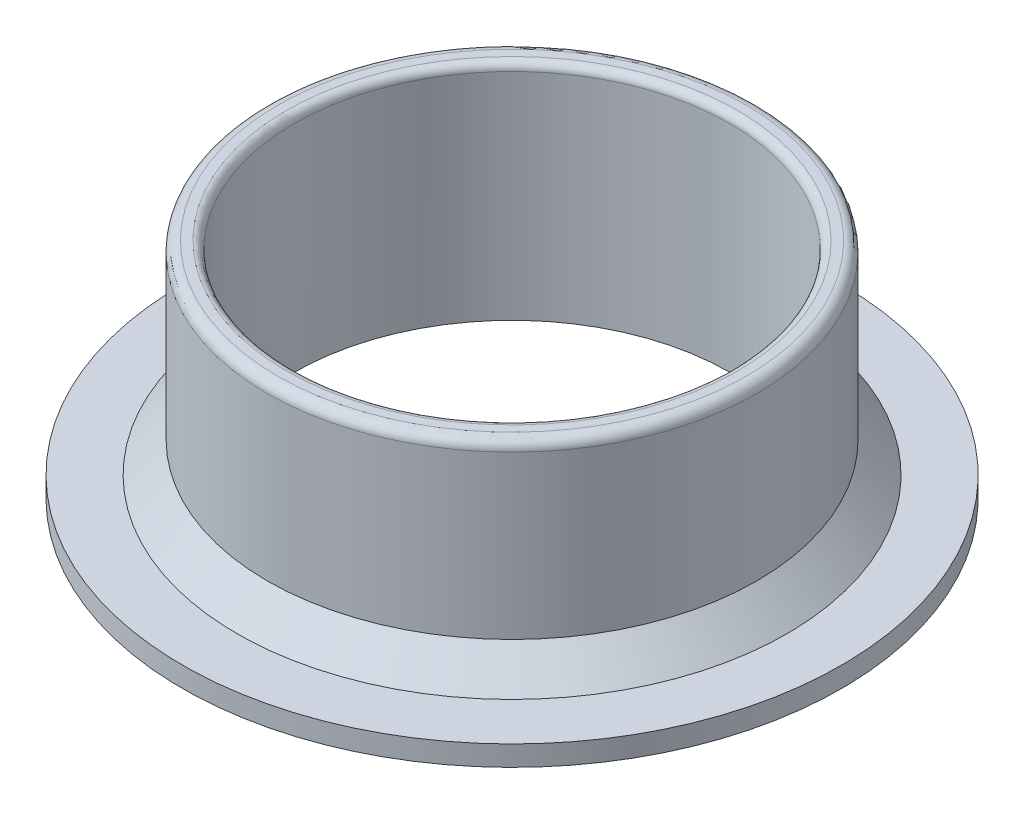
ISO-10303-21;
HEADER;
FILE_DESCRIPTION(('STEP AP214'),'2;1');
FILE_NAME('part.step','',(''),(''),'','','');
FILE_SCHEMA(('AUTOMOTIVE_DESIGN { 1 0 10303 214 1 1 1 1 }'));
ENDSEC;
DATA;
#1=APPLICATION_CONTEXT('core data for automotive mechanical design processes');
#2=APPLICATION_PROTOCOL_DEFINITION('international standard','automotive_design',2000,#1);
#3=PRODUCT_CONTEXT('',#1,'mechanical');
#4=PRODUCT('Part','Part','',(#3));
#5=PRODUCT_RELATED_PRODUCT_CATEGORY('part','',(#4));
#6=PRODUCT_DEFINITION_FORMATION('','',#4);
#7=PRODUCT_DEFINITION_CONTEXT('part definition',#1,'design');
#8=PRODUCT_DEFINITION('design','',#6,#7);
#9=PRODUCT_DEFINITION_SHAPE('','',#8);
#10=(LENGTH_UNIT() NAMED_UNIT(*) SI_UNIT(.MILLI.,.METRE.));
#11=(NAMED_UNIT(*) PLANE_ANGLE_UNIT() SI_UNIT($,.RADIAN.));
#12=(NAMED_UNIT(*) SI_UNIT($,.STERADIAN.) SOLID_ANGLE_UNIT());
#13=UNCERTAINTY_MEASURE_WITH_UNIT(LENGTH_MEASURE(1.E-05),#10,'distance_accuracy_value','');
#14=(GEOMETRIC_REPRESENTATION_CONTEXT(3) GLOBAL_UNCERTAINTY_ASSIGNED_CONTEXT((#13)) GLOBAL_UNIT_ASSIGNED_CONTEXT((#10,
#11,#12)) REPRESENTATION_CONTEXT('',''));
#15=CARTESIAN_POINT('',(0.,0.,0.));
#16=DIRECTION('',(0.,0.,1.));
#17=DIRECTION('',(1.,0.,0.));
#18=AXIS2_PLACEMENT_3D('',#15,#16,#17);
#19=CARTESIAN_POINT('',(0.,10.,0.));
#20=DIRECTION('',(0.,1.,0.));
#21=DIRECTION('',(0.,0.,1.));
#22=AXIS2_PLACEMENT_3D('',#19,#20,#21);
#23=PLANE('',#22);
#24=CARTESIAN_POINT('',(0.,10.,0.));
#25=DIRECTION('',(0.,1.,0.));
#26=DIRECTION('',(0.,0.,1.));
#27=AXIS2_PLACEMENT_3D('',#24,#25,#26);
#28=CIRCLE('',#27,22.25);
#29=CARTESIAN_POINT('',(0.,10.,22.25));
#30=VERTEX_POINT('',#29);
#31=EDGE_CURVE('E10',#30,#30,#28,.F.);
#32=ORIENTED_EDGE('',*,*,#31,.T.);
#33=EDGE_LOOP('',(#32));
#34=FACE_BOUND('',#33,.T.);
#35=CARTESIAN_POINT('',(0.,10.,0.));
#36=DIRECTION('',(0.,1.,0.));
#37=DIRECTION('',(0.,0.,1.));
#38=AXIS2_PLACEMENT_3D('',#35,#36,#37);
#39=CIRCLE('',#38,23.125);
#40=CARTESIAN_POINT('',(0.,10.,23.125));
#41=VERTEX_POINT('',#40);
#42=EDGE_CURVE('E48',#41,#41,#39,.T.);
#43=ORIENTED_EDGE('',*,*,#42,.T.);
#44=EDGE_LOOP('',(#43));
#45=FACE_BOUND('',#44,.T.);
#46=ADVANCED_FACE('F33',(#34,#45),#23,.T.);
#47=CARTESIAN_POINT('',(0.,10.,0.));
#48=DIRECTION('',(0.,-1.,0.));
#49=DIRECTION('',(0.,0.,-1.));
#50=AXIS2_PLACEMENT_3D('',#47,#48,#49);
#51=CYLINDRICAL_SURFACE('',#50,24.125);
#52=CARTESIAN_POINT('',(0.,9.,0.));
#53=DIRECTION('',(0.,1.,0.));
#54=DIRECTION('',(0.,0.,1.));
#55=AXIS2_PLACEMENT_3D('',#52,#53,#54);
#56=CIRCLE('',#55,24.125);
#57=CARTESIAN_POINT('',(0.,9.,24.125));
#58=VERTEX_POINT('',#57);
#59=EDGE_CURVE('E44',#58,#58,#56,.F.);
#60=ORIENTED_EDGE('',*,*,#59,.T.);
#61=EDGE_LOOP('',(#60));
#62=FACE_BOUND('',#61,.T.);
#63=CARTESIAN_POINT('',(0.,-6.99999999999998,0.));
#64=DIRECTION('',(0.,-1.,0.));
#65=DIRECTION('',(0.,0.,-1.));
#66=AXIS2_PLACEMENT_3D('',#63,#64,#65);
#67=CIRCLE('',#66,24.125);
#68=CARTESIAN_POINT('',(0.,-6.99999999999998,-24.125));
#69=VERTEX_POINT('',#68);
#70=EDGE_CURVE('E56',#69,#69,#67,.F.);
#71=ORIENTED_EDGE('',*,*,#70,.T.);
#72=EDGE_LOOP('',(#71));
#73=FACE_BOUND('',#72,.T.);
#74=ADVANCED_FACE('F83',(#62,#73),#51,.T.);
#75=CARTESIAN_POINT('',(0.,10.,0.));
#76=DIRECTION('',(0.,-1.,0.));
#77=DIRECTION('',(0.,0.,-1.));
#78=AXIS2_PLACEMENT_3D('',#75,#76,#77);
#79=CYLINDRICAL_SURFACE('',#78,21.5);
#80=CARTESIAN_POINT('',(0.,9.25,0.));
#81=DIRECTION('',(0.,1.,0.));
#82=DIRECTION('',(0.,0.,1.));
#83=AXIS2_PLACEMENT_3D('',#80,#81,#82);
#84=CIRCLE('',#83,21.5);
#85=CARTESIAN_POINT('',(0.,9.25,21.5));
#86=VERTEX_POINT('',#85);
#87=EDGE_CURVE('E40',#86,#86,#84,.T.);
#88=ORIENTED_EDGE('',*,*,#87,.T.);
#89=EDGE_LOOP('',(#88));
#90=FACE_BOUND('',#89,.T.);
#91=CARTESIAN_POINT('',(0.,-12.,0.));
#92=DIRECTION('',(0.,-1.,0.));
#93=DIRECTION('',(0.,0.,-1.));
#94=AXIS2_PLACEMENT_3D('',#91,#92,#93);
#95=CIRCLE('',#94,21.5);
#96=CARTESIAN_POINT('',(0.,-12.,-21.5));
#97=VERTEX_POINT('',#96);
#98=EDGE_CURVE('E63',#97,#97,#95,.T.);
#99=ORIENTED_EDGE('',*,*,#98,.T.);
#100=EDGE_LOOP('',(#99));
#101=FACE_BOUND('',#100,.T.);
#102=ADVANCED_FACE('F69',(#90,#101),#79,.F.);
#103=CARTESIAN_POINT('',(0.,-12.,0.));
#104=DIRECTION('',(0.,-1.,0.));
#105=DIRECTION('',(0.,0.,-1.));
#106=AXIS2_PLACEMENT_3D('',#103,#104,#105);
#107=PLANE('',#106);
#108=CARTESIAN_POINT('',(0.,-12.,0.));
#109=DIRECTION('',(0.,-1.,0.));
#110=DIRECTION('',(0.,0.,-1.));
#111=AXIS2_PLACEMENT_3D('',#108,#109,#110);
#112=CIRCLE('',#111,32.5);
#113=CARTESIAN_POINT('',(0.,-12.,-32.5));
#114=VERTEX_POINT('',#113);
#115=EDGE_CURVE('E59',#114,#114,#112,.T.);
#116=ORIENTED_EDGE('',*,*,#115,.T.);
#117=EDGE_LOOP('',(#116));
#118=FACE_BOUND('',#117,.T.);
#119=ORIENTED_EDGE('',*,*,#98,.F.);
#120=EDGE_LOOP('',(#119));
#121=FACE_BOUND('',#120,.T.);
#122=ADVANCED_FACE('F71',(#118,#121),#107,.T.);
#123=CARTESIAN_POINT('',(0.,-10.,0.));
#124=DIRECTION('',(0.,-1.,0.));
#125=DIRECTION('',(0.,0.,-1.));
#126=AXIS2_PLACEMENT_3D('',#123,#124,#125);
#127=PLANE('',#126);
#128=CARTESIAN_POINT('',(0.,-10.,0.));
#129=DIRECTION('',(0.,-1.,0.));
#130=DIRECTION('',(0.,0.,-1.));
#131=AXIS2_PLACEMENT_3D('',#128,#129,#130);
#132=CIRCLE('',#131,27.125);
#133=CARTESIAN_POINT('',(0.,-10.,-27.125));
#134=VERTEX_POINT('',#133);
#135=EDGE_CURVE('E53',#134,#134,#132,.T.);
#136=ORIENTED_EDGE('',*,*,#135,.T.);
#137=EDGE_LOOP('',(#136));
#138=FACE_BOUND('',#137,.T.);
#139=CARTESIAN_POINT('',(0.,-10.,0.));
#140=DIRECTION('',(0.,-1.,0.));
#141=DIRECTION('',(0.,0.,-1.));
#142=AXIS2_PLACEMENT_3D('',#139,#140,#141);
#143=CIRCLE('',#142,32.5);
#144=CARTESIAN_POINT('',(0.,-10.,-32.5));
#145=VERTEX_POINT('',#144);
#146=EDGE_CURVE('E60',#145,#145,#143,.T.);
#147=ORIENTED_EDGE('',*,*,#146,.F.);
#148=EDGE_LOOP('',(#147));
#149=FACE_BOUND('',#148,.T.);
#150=ADVANCED_FACE('F73',(#138,#149),#127,.F.);
#151=CARTESIAN_POINT('',(0.,-12.,0.));
#152=DIRECTION('',(0.,1.,0.));
#153=DIRECTION('',(0.,0.,1.));
#154=AXIS2_PLACEMENT_3D('',#151,#152,#153);
#155=CYLINDRICAL_SURFACE('',#154,32.5);
#156=ORIENTED_EDGE('',*,*,#115,.F.);
#157=EDGE_LOOP('',(#156));
#158=FACE_BOUND('',#157,.T.);
#159=ORIENTED_EDGE('',*,*,#146,.T.);
#160=EDGE_LOOP('',(#159));
#161=FACE_BOUND('',#160,.T.);
#162=ADVANCED_FACE('F80',(#158,#161),#155,.T.);
#163=CARTESIAN_POINT('',(0.,-6.99999999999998,0.));
#164=DIRECTION('',(0.,-1.,0.));
#165=DIRECTION('',(0.,0.,-1.));
#166=AXIS2_PLACEMENT_3D('',#163,#164,#165);
#167=CONICAL_SURFACE('',#166,24.125,0.785398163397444);
#168=ORIENTED_EDGE('',*,*,#135,.F.);
#169=EDGE_LOOP('',(#168));
#170=FACE_BOUND('',#169,.T.);
#171=ORIENTED_EDGE('',*,*,#70,.F.);
#172=EDGE_LOOP('',(#171));
#173=FACE_BOUND('',#172,.T.);
#174=ADVANCED_FACE('F95',(#170,#173),#167,.T.);
#175=CARTESIAN_POINT('',(0.,9.,0.));
#176=DIRECTION('',(0.,1.,0.));
#177=DIRECTION('',(0.,0.,1.));
#178=AXIS2_PLACEMENT_3D('',#175,#176,#177);
#179=TOROIDAL_SURFACE('',#178,23.125,1.);
#180=ORIENTED_EDGE('',*,*,#59,.F.);
#181=EDGE_LOOP('',(#180));
#182=FACE_BOUND('',#181,.T.);
#183=ORIENTED_EDGE('',*,*,#42,.F.);
#184=EDGE_LOOP('',(#183));
#185=FACE_BOUND('',#184,.T.);
#186=ADVANCED_FACE('F97',(#182,#185),#179,.T.);
#187=CARTESIAN_POINT('',(0.,9.25,0.));
#188=DIRECTION('',(0.,1.,0.));
#189=DIRECTION('',(0.,0.,1.));
#190=AXIS2_PLACEMENT_3D('',#187,#188,#189);
#191=TOROIDAL_SURFACE('',#190,22.25,0.75);
#192=ORIENTED_EDGE('',*,*,#31,.F.);
#193=EDGE_LOOP('',(#192));
#194=FACE_BOUND('',#193,.T.);
#195=ORIENTED_EDGE('',*,*,#87,.F.);
#196=EDGE_LOOP('',(#195));
#197=FACE_BOUND('',#196,.T.);
#198=ADVANCED_FACE('F35',(#194,#197),#191,.T.);
#199=CLOSED_SHELL('',(#46,#74,#102,#122,#150,#162,#174,#186,#198));
#200=MANIFOLD_SOLID_BREP('B2',#199);
#201=ADVANCED_BREP_SHAPE_REPRESENTATION('',(#18,#200),#14);
#202=SHAPE_DEFINITION_REPRESENTATION(#9,#201);
ENDSEC;
END-ISO-10303-21;
